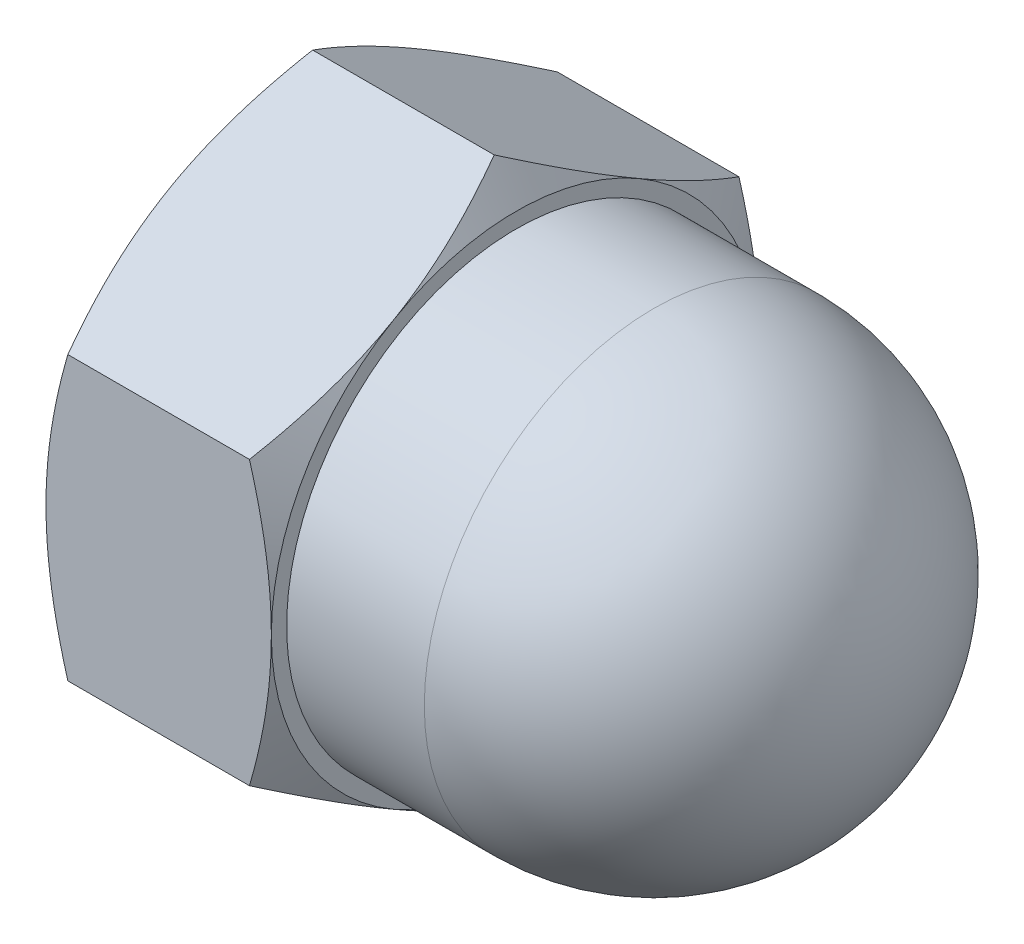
ISO-10303-21;
HEADER;
FILE_DESCRIPTION(('STEP AP214'),'2;1');
FILE_NAME('part.step','',(''),(''),'','','');
FILE_SCHEMA(('AUTOMOTIVE_DESIGN { 1 0 10303 214 1 1 1 1 }'));
ENDSEC;
DATA;
#1=APPLICATION_CONTEXT('core data for automotive mechanical design processes');
#2=APPLICATION_PROTOCOL_DEFINITION('international standard','automotive_design',2000,#1);
#3=PRODUCT_CONTEXT('',#1,'mechanical');
#4=PRODUCT('Part','Part','',(#3));
#5=PRODUCT_RELATED_PRODUCT_CATEGORY('part','',(#4));
#6=PRODUCT_DEFINITION_FORMATION('','',#4);
#7=PRODUCT_DEFINITION_CONTEXT('part definition',#1,'design');
#8=PRODUCT_DEFINITION('design','',#6,#7);
#9=PRODUCT_DEFINITION_SHAPE('','',#8);
#10=(LENGTH_UNIT() NAMED_UNIT(*) SI_UNIT(.MILLI.,.METRE.));
#11=(NAMED_UNIT(*) PLANE_ANGLE_UNIT() SI_UNIT($,.RADIAN.));
#12=(NAMED_UNIT(*) SI_UNIT($,.STERADIAN.) SOLID_ANGLE_UNIT());
#13=UNCERTAINTY_MEASURE_WITH_UNIT(LENGTH_MEASURE(1.E-05),#10,'distance_accuracy_value','');
#14=(GEOMETRIC_REPRESENTATION_CONTEXT(3) GLOBAL_UNCERTAINTY_ASSIGNED_CONTEXT((#13)) GLOBAL_UNIT_ASSIGNED_CONTEXT((#10,
#11,#12)) REPRESENTATION_CONTEXT('',''));
#15=CARTESIAN_POINT('',(0.,0.,0.));
#16=DIRECTION('',(0.,0.,1.));
#17=DIRECTION('',(1.,0.,0.));
#18=AXIS2_PLACEMENT_3D('',#15,#16,#17);
#19=CARTESIAN_POINT('',(6.25,0.,0.));
#20=DIRECTION('',(1.,0.,0.));
#21=DIRECTION('',(0.,1.,0.));
#22=AXIS2_PLACEMENT_3D('',#19,#20,#21);
#23=SPHERICAL_SURFACE('',#22,3.75);
#24=CARTESIAN_POINT('',(10.,0.,0.));
#25=VERTEX_POINT('',#24);
#26=VERTEX_LOOP('',#25);
#27=FACE_BOUND('',#26,.T.);
#28=CARTESIAN_POINT('',(6.25,0.,0.));
#29=DIRECTION('',(1.,0.,0.));
#30=DIRECTION('',(0.,0.,-1.));
#31=AXIS2_PLACEMENT_3D('',#28,#29,#30);
#32=CIRCLE('',#31,3.75);
#33=CARTESIAN_POINT('',(6.25,0.,-3.75));
#34=VERTEX_POINT('',#33);
#35=EDGE_CURVE('E306',#34,#34,#32,.F.);
#36=ORIENTED_EDGE('',*,*,#35,.F.);
#37=EDGE_LOOP('',(#36));
#38=FACE_BOUND('',#37,.T.);
#39=ADVANCED_FACE('F16',(#27,#38),#23,.T.);
#40=CARTESIAN_POINT('',(5.125,0.,0.));
#41=DIRECTION('',(1.,0.,0.));
#42=DIRECTION('',(0.,0.,-1.));
#43=AXIS2_PLACEMENT_3D('',#40,#41,#42);
#44=CYLINDRICAL_SURFACE('',#43,3.75);
#45=CARTESIAN_POINT('',(4.,0.,0.));
#46=DIRECTION('',(1.,0.,0.));
#47=DIRECTION('',(0.,0.,-1.));
#48=AXIS2_PLACEMENT_3D('',#45,#46,#47);
#49=CIRCLE('',#48,3.75);
#50=CARTESIAN_POINT('',(4.,0.,-3.75));
#51=VERTEX_POINT('',#50);
#52=EDGE_CURVE('E20',#51,#51,#49,.F.);
#53=ORIENTED_EDGE('',*,*,#52,.F.);
#54=EDGE_LOOP('',(#53));
#55=FACE_BOUND('',#54,.T.);
#56=ORIENTED_EDGE('',*,*,#35,.T.);
#57=EDGE_LOOP('',(#56));
#58=FACE_BOUND('',#57,.T.);
#59=ADVANCED_FACE('F317',(#55,#58),#44,.T.);
#60=CARTESIAN_POINT('',(4.,0.,0.));
#61=DIRECTION('',(1.,0.,0.));
#62=DIRECTION('',(0.,0.,-1.));
#63=AXIS2_PLACEMENT_3D('',#60,#61,#62);
#64=PLANE('',#63);
#65=ORIENTED_EDGE('',*,*,#52,.T.);
#66=EDGE_LOOP('',(#65));
#67=FACE_BOUND('',#66,.T.);
#68=CARTESIAN_POINT('',(4.00000000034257,0.,0.));
#69=DIRECTION('',(-1.,0.,0.));
#70=DIRECTION('',(0.,0.,1.));
#71=AXIS2_PLACEMENT_3D('',#68,#69,#70);
#72=CIRCLE('',#71,4.00000000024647);
#73=CARTESIAN_POINT('',(4.00000000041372,-3.46410161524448,-2.00000000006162));
#74=VERTEX_POINT('',#73);
#75=CARTESIAN_POINT('',(4.00000000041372,-3.46410161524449,2.00000000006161));
#76=VERTEX_POINT('',#75);
#77=EDGE_CURVE('E88',#74,#76,#72,.T.);
#78=ORIENTED_EDGE('',*,*,#77,.F.);
#79=CARTESIAN_POINT('',(4.00000000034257,0.,0.));
#80=DIRECTION('',(-1.,0.,0.));
#81=DIRECTION('',(0.,0.,1.));
#82=AXIS2_PLACEMENT_3D('',#79,#80,#81);
#83=CIRCLE('',#82,4.00000000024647);
#84=CARTESIAN_POINT('',(4.00000000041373,0.,-4.00000000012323));
#85=VERTEX_POINT('',#84);
#86=EDGE_CURVE('E281',#85,#74,#83,.T.);
#87=ORIENTED_EDGE('',*,*,#86,.F.);
#88=CARTESIAN_POINT('',(4.00000000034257,0.,0.));
#89=DIRECTION('',(-1.,0.,0.));
#90=DIRECTION('',(0.,0.,1.));
#91=AXIS2_PLACEMENT_3D('',#88,#89,#90);
#92=CIRCLE('',#91,4.00000000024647);
#93=CARTESIAN_POINT('',(4.00000000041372,3.46410161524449,-2.00000000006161));
#94=VERTEX_POINT('',#93);
#95=EDGE_CURVE('E284',#94,#85,#92,.T.);
#96=ORIENTED_EDGE('',*,*,#95,.F.);
#97=CARTESIAN_POINT('',(4.00000000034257,0.,0.));
#98=DIRECTION('',(-1.,0.,0.));
#99=DIRECTION('',(0.,0.,1.));
#100=AXIS2_PLACEMENT_3D('',#97,#98,#99);
#101=CIRCLE('',#100,4.00000000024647);
#102=CARTESIAN_POINT('',(4.00000000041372,3.46410161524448,2.00000000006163));
#103=VERTEX_POINT('',#102);
#104=EDGE_CURVE('E106',#103,#94,#101,.T.);
#105=ORIENTED_EDGE('',*,*,#104,.F.);
#106=CARTESIAN_POINT('',(4.00000000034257,0.,0.));
#107=DIRECTION('',(-1.,0.,0.));
#108=DIRECTION('',(0.,0.,1.));
#109=AXIS2_PLACEMENT_3D('',#106,#107,#108);
#110=CIRCLE('',#109,4.00000000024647);
#111=CARTESIAN_POINT('',(4.00000000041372,0.,4.00000000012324));
#112=VERTEX_POINT('',#111);
#113=EDGE_CURVE('E102',#112,#103,#110,.T.);
#114=ORIENTED_EDGE('',*,*,#113,.F.);
#115=CARTESIAN_POINT('',(4.00000000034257,0.,0.));
#116=DIRECTION('',(-1.,0.,0.));
#117=DIRECTION('',(0.,0.,1.));
#118=AXIS2_PLACEMENT_3D('',#115,#116,#117);
#119=CIRCLE('',#118,4.00000000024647);
#120=EDGE_CURVE('E94',#76,#112,#119,.T.);
#121=ORIENTED_EDGE('',*,*,#120,.F.);
#122=EDGE_LOOP('',(#78,#87,#96,#105,#114,#121));
#123=FACE_BOUND('',#122,.T.);
#124=ADVANCED_FACE('F104',(#67,#123),#64,.T.);
#125=CARTESIAN_POINT('',(3.6405908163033,0.,0.));
#126=DIRECTION('',(-1.,0.,0.));
#127=DIRECTION('',(0.,0.,1.));
#128=AXIS2_PLACEMENT_3D('',#125,#126,#127);
#129=CONICAL_SURFACE('',#128,4.62251496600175,1.0471975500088);
#130=CARTESIAN_POINT('',(4.0000000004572,-3.46410161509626,1.99999999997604));
#131=CARTESIAN_POINT('',(4.00001634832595,-3.41509105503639,2.08488878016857));
#132=CARTESIAN_POINT('',(3.99792016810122,-3.3660828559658,2.16977347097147));
#133=CARTESIAN_POINT('',(3.98962425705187,-3.26816268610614,2.33937618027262));
#134=CARTESIAN_POINT('',(3.98342533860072,-3.21925069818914,2.4240942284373));
#135=CARTESIAN_POINT('',(3.96708627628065,-3.12183888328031,2.59281644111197));
#136=CARTESIAN_POINT('',(3.95696597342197,-3.07333821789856,2.67682205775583));
#137=CARTESIAN_POINT('',(3.93300183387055,-2.97656796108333,2.84443305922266));
#138=CARTESIAN_POINT('',(3.91915789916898,-2.92829837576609,2.92803843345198));
#139=CARTESIAN_POINT('',(3.87246832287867,-2.78403632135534,3.17790764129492));
#140=CARTESIAN_POINT('',(3.83444223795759,-2.68846293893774,3.34344559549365));
#141=CARTESIAN_POINT('',(3.74674436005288,-2.49813806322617,3.67309795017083));
#142=CARTESIAN_POINT('',(3.69701440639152,-2.40339320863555,3.83720085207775));
#143=CARTESIAN_POINT('',(3.64273440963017,-2.3094010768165,3.99999999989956));
#144=B_SPLINE_CURVE_WITH_KNOTS('',3,(#130,#131,#132,#133,#134,#135,#136,#137,#138,#139,#140,
#141,#142,#143),.UNSPECIFIED.,.F.,.F.,(4,2,2,2,2,2,4),(0.,0.294033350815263,0.588008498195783,
0.880515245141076,1.17302969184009,1.7572919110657,2.34452123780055),.UNSPECIFIED.);
#145=CARTESIAN_POINT('',(3.64273440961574,-2.3094010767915,3.99999999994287));
#146=VERTEX_POINT('',#145);
#147=EDGE_CURVE('E99',#76,#146,#144,.T.);
#148=ORIENTED_EDGE('',*,*,#147,.F.);
#149=ORIENTED_EDGE('',*,*,#120,.T.);
#150=CARTESIAN_POINT('',(3.64273440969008,-2.30940107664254,4.00000000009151));
#151=CARTESIAN_POINT('',(3.69701440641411,-2.1214168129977,4.00000000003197));
#152=CARTESIAN_POINT('',(3.74674436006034,-1.93192710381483,4.00000000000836));
#153=CARTESIAN_POINT('',(3.83444223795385,-1.55127735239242,3.99999999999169));
#154=CARTESIAN_POINT('',(3.87246832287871,-1.36013058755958,3.99999999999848));
#155=CARTESIAN_POINT('',(3.91915789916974,-1.07160647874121,4.00000000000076));
#156=CARTESIAN_POINT('',(3.93300183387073,-0.975067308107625,4.00000000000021));
#157=CARTESIAN_POINT('',(3.95696597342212,-0.781526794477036,3.9999999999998));
#158=CARTESIAN_POINT('',(3.96708627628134,-0.684525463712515,3.99999999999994));
#159=CARTESIAN_POINT('',(3.98342533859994,-0.489701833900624,4.00000000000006));
#160=CARTESIAN_POINT('',(3.98962425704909,-0.391877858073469,4.00000000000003));
#161=CARTESIAN_POINT('',(3.99792016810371,-0.196037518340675,3.99999999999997));
#162=CARTESIAN_POINT('',(4.00001634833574,-0.098021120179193,3.99999999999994));
#163=CARTESIAN_POINT('',(4.00000000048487,-7.99137315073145E-12,4.));
#164=B_SPLINE_CURVE_WITH_KNOTS('',3,(#150,#151,#152,#153,#154,#155,#156,#157,#158,#159,#160,
#161,#162,#163),.UNSPECIFIED.,.F.,.F.,(4,2,2,2,2,2,4),(0.,0.587229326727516,1.17149154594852,
1.46400599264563,1.75651273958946,2.05048788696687,2.34452123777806),.UNSPECIFIED.);
#165=EDGE_CURVE('E98',#146,#112,#164,.T.);
#166=ORIENTED_EDGE('',*,*,#165,.F.);
#167=EDGE_LOOP('',(#148,#149,#166));
#168=FACE_BOUND('',#167,.T.);
#169=ADVANCED_FACE('F96',(#168),#129,.T.);
#170=CARTESIAN_POINT('',(3.6405908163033,0.,0.));
#171=DIRECTION('',(-1.,0.,0.));
#172=DIRECTION('',(0.,0.,1.));
#173=AXIS2_PLACEMENT_3D('',#170,#171,#172);
#174=CONICAL_SURFACE('',#173,4.62251496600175,1.0471975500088);
#175=ORIENTED_EDGE('',*,*,#113,.T.);
#176=CARTESIAN_POINT('',(3.64273440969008,2.30940107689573,3.99999999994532));
#177=CARTESIAN_POINT('',(3.69701440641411,2.40339320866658,3.83720085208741));
#178=CARTESIAN_POINT('',(3.74674436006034,2.49813806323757,3.67309795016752));
#179=CARTESIAN_POINT('',(3.83444223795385,2.68846293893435,3.34344559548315));
#180=CARTESIAN_POINT('',(3.87246832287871,2.78403632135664,3.17790764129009));
#181=CARTESIAN_POINT('',(3.91915789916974,2.92829837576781,2.92803843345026));
#182=CARTESIAN_POINT('',(3.93300183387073,2.97656796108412,2.84443305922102));
#183=CARTESIAN_POINT('',(3.95696597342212,3.07333821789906,2.67682205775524));
#184=CARTESIAN_POINT('',(3.96708627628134,3.12183888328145,2.59281644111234));
#185=CARTESIAN_POINT('',(3.98342533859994,3.21925069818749,2.4240942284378));
#186=CARTESIAN_POINT('',(3.98962425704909,3.26816268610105,2.33937618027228));
#187=CARTESIAN_POINT('',(3.99792016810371,3.36608285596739,2.16977347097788));
#188=CARTESIAN_POINT('',(4.00001634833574,3.41509105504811,2.08488878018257));
#189=CARTESIAN_POINT('',(4.00000000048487,3.46410161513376,2.00000000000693));
#190=B_SPLINE_CURVE_WITH_KNOTS('',3,(#176,#177,#178,#179,#180,#181,#182,#183,#184,#185,#186,
#187,#188,#189),.UNSPECIFIED.,.F.,.F.,(4,2,2,2,2,2,4),(0.,0.587229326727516,1.17149154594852,
1.46400599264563,1.75651273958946,2.05048788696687,2.34452123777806),.UNSPECIFIED.);
#191=CARTESIAN_POINT('',(3.64273440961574,2.30940107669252,4.00000000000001));
#192=VERTEX_POINT('',#191);
#193=EDGE_CURVE('E122',#192,#103,#190,.T.);
#194=ORIENTED_EDGE('',*,*,#193,.F.);
#195=CARTESIAN_POINT('',(4.0000000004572,0.,3.99999999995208));
#196=CARTESIAN_POINT('',(4.00001634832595,0.09802112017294,3.9999999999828));
#197=CARTESIAN_POINT('',(3.99792016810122,0.196037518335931,3.99999999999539));
#198=CARTESIAN_POINT('',(3.98962425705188,0.391877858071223,4.00000000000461));
#199=CARTESIAN_POINT('',(3.98342533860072,0.489701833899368,4.00000000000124));
#200=CARTESIAN_POINT('',(3.96708627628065,0.684525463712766,3.99999999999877));
#201=CARTESIAN_POINT('',(3.95696597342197,0.781526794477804,3.99999999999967));
#202=CARTESIAN_POINT('',(3.93300183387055,0.975067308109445,4.00000000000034));
#203=CARTESIAN_POINT('',(3.91915789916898,1.07160647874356,4.00000000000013));
#204=CARTESIAN_POINT('',(3.87246832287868,1.36013058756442,3.99999999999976));
#205=CARTESIAN_POINT('',(3.8344422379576,1.55127735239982,3.99999999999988));
#206=CARTESIAN_POINT('',(3.74674436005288,1.9319271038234,4.00000000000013));
#207=CARTESIAN_POINT('',(3.69701440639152,2.12141681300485,4.00000000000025));
#208=CARTESIAN_POINT('',(3.64273440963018,2.30940107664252,4.));
#209=B_SPLINE_CURVE_WITH_KNOTS('',3,(#195,#196,#197,#198,#199,#200,#201,#202,#203,#204,#205,
#206,#207,#208),.UNSPECIFIED.,.F.,.F.,(4,2,2,2,2,2,4),(0.,0.294033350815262,0.588008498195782,
0.880515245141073,1.17302969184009,1.7572919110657,2.34452123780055),.UNSPECIFIED.);
#210=EDGE_CURVE('E117',#112,#192,#209,.T.);
#211=ORIENTED_EDGE('',*,*,#210,.F.);
#212=EDGE_LOOP('',(#175,#194,#211));
#213=FACE_BOUND('',#212,.T.);
#214=ADVANCED_FACE('F124',(#213),#174,.T.);
#215=CARTESIAN_POINT('',(3.6405908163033,0.,0.));
#216=DIRECTION('',(-1.,0.,0.));
#217=DIRECTION('',(0.,0.,1.));
#218=AXIS2_PLACEMENT_3D('',#215,#216,#217);
#219=CONICAL_SURFACE('',#218,4.62251496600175,1.0471975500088);
#220=ORIENTED_EDGE('',*,*,#104,.T.);
#221=CARTESIAN_POINT('',(3.64273440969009,4.61880215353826,-1.46183903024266E-10));
#222=CARTESIAN_POINT('',(3.69701440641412,4.52481002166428,-0.162799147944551));
#223=CARTESIAN_POINT('',(3.74674436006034,4.43006516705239,-0.32690204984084));
#224=CARTESIAN_POINT('',(3.83444223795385,4.23974029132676,-0.656554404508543));
#225=CARTESIAN_POINT('',(3.87246832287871,4.14416690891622,-0.822092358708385));
#226=CARTESIAN_POINT('',(3.91915789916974,3.99990485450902,-1.0719615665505));
#227=CARTESIAN_POINT('',(3.93300183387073,3.95163526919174,-1.15556694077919));
#228=CARTESIAN_POINT('',(3.95696597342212,3.85486501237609,-1.32317794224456));
#229=CARTESIAN_POINT('',(3.96708627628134,3.80636434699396,-1.4071835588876));
#230=CARTESIAN_POINT('',(3.98342533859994,3.70895253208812,-1.57590577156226));
#231=CARTESIAN_POINT('',(3.98962425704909,3.66004054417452,-1.66062381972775));
#232=CARTESIAN_POINT('',(3.99792016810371,3.56212037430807,-1.8302265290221));
#233=CARTESIAN_POINT('',(4.00001634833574,3.5131121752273,-1.91511121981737));
#234=CARTESIAN_POINT('',(4.00000000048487,3.46410161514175,-1.99999999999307));
#235=B_SPLINE_CURVE_WITH_KNOTS('',3,(#221,#222,#223,#224,#225,#226,#227,#228,#229,#230,#231,
#232,#233,#234),.UNSPECIFIED.,.F.,.F.,(4,2,2,2,2,2,4),(0.,0.587229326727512,1.17149154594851,
1.46400599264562,1.75651273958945,2.05048788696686,2.34452123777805),.UNSPECIFIED.);
#236=CARTESIAN_POINT('',(3.64273440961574,4.61880215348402,5.71387160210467E-11));
#237=VERTEX_POINT('',#236);
#238=EDGE_CURVE('E289',#237,#94,#235,.T.);
#239=ORIENTED_EDGE('',*,*,#238,.F.);
#240=CARTESIAN_POINT('',(4.0000000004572,3.46410161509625,1.99999999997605));
#241=CARTESIAN_POINT('',(4.00001634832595,3.51311217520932,1.91511121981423));
#242=CARTESIAN_POINT('',(3.99792016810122,3.56212037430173,1.83022652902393));
#243=CARTESIAN_POINT('',(3.98962425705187,3.66004054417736,1.660623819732));
#244=CARTESIAN_POINT('',(3.98342533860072,3.70895253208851,1.57590577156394));
#245=CARTESIAN_POINT('',(3.96708627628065,3.80636434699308,1.40718355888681));
#246=CARTESIAN_POINT('',(3.95696597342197,3.85486501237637,1.32317794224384));
#247=CARTESIAN_POINT('',(3.93300183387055,3.95163526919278,1.15556694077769));
#248=CARTESIAN_POINT('',(3.91915789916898,3.99990485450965,1.07196156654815));
#249=CARTESIAN_POINT('',(3.87246832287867,4.14416690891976,0.822092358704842));
#250=CARTESIAN_POINT('',(3.83444223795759,4.23974029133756,0.656554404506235));
#251=CARTESIAN_POINT('',(3.74674436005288,4.43006516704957,0.326902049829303));
#252=CARTESIAN_POINT('',(3.69701440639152,4.5248100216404,0.162799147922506));
#253=CARTESIAN_POINT('',(3.64273440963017,4.61880215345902,1.00448255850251E-10));
#254=B_SPLINE_CURVE_WITH_KNOTS('',3,(#240,#241,#242,#243,#244,#245,#246,#247,#248,#249,#250,
#251,#252,#253),.UNSPECIFIED.,.F.,.F.,(4,2,2,2,2,2,4),(0.,0.294033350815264,0.588008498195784,
0.880515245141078,1.17302969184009,1.75729191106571,2.34452123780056),.UNSPECIFIED.);
#255=EDGE_CURVE('E160',#103,#237,#254,.T.);
#256=ORIENTED_EDGE('',*,*,#255,.F.);
#257=EDGE_LOOP('',(#220,#239,#256));
#258=FACE_BOUND('',#257,.T.);
#259=ADVANCED_FACE('F150',(#258),#219,.T.);
#260=CARTESIAN_POINT('',(3.6405908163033,0.,0.));
#261=DIRECTION('',(-1.,0.,0.));
#262=DIRECTION('',(0.,0.,1.));
#263=AXIS2_PLACEMENT_3D('',#260,#261,#262);
#264=CONICAL_SURFACE('',#263,4.62251496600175,1.0471975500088);
#265=ORIENTED_EDGE('',*,*,#95,.T.);
#266=CARTESIAN_POINT('',(3.64273440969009,2.30940107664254,-4.00000000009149));
#267=CARTESIAN_POINT('',(3.69701440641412,2.1214168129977,-4.00000000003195));
#268=CARTESIAN_POINT('',(3.74674436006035,1.93192710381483,-4.00000000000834));
#269=CARTESIAN_POINT('',(3.83444223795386,1.55127735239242,-3.99999999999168));
#270=CARTESIAN_POINT('',(3.87246832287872,1.36013058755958,-3.99999999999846));
#271=CARTESIAN_POINT('',(3.91915789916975,1.07160647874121,-4.00000000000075));
#272=CARTESIAN_POINT('',(3.93300183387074,0.97506730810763,-4.00000000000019));
#273=CARTESIAN_POINT('',(3.95696597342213,0.78152679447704,-3.99999999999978));
#274=CARTESIAN_POINT('',(3.96708627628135,0.68452546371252,-3.99999999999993));
#275=CARTESIAN_POINT('',(3.98342533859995,0.489701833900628,-4.00000000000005));
#276=CARTESIAN_POINT('',(3.9896242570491,0.391877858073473,-4.00000000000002));
#277=CARTESIAN_POINT('',(3.99792016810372,0.19603751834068,-3.99999999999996));
#278=CARTESIAN_POINT('',(4.00001634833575,0.0980211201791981,-3.99999999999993));
#279=CARTESIAN_POINT('',(4.00000000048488,7.99652713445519E-12,-3.99999999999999));
#280=B_SPLINE_CURVE_WITH_KNOTS('',3,(#266,#267,#268,#269,#270,#271,#272,#273,#274,#275,#276,
#277,#278,#279),.UNSPECIFIED.,.F.,.F.,(4,2,2,2,2,2,4),(0.,0.587229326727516,1.17149154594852,
1.46400599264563,1.75651273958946,2.05048788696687,2.34452123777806),.UNSPECIFIED.);
#281=CARTESIAN_POINT('',(3.64273440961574,2.3094010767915,-3.99999999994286));
#282=VERTEX_POINT('',#281);
#283=EDGE_CURVE('E232',#282,#85,#280,.T.);
#284=ORIENTED_EDGE('',*,*,#283,.F.);
#285=CARTESIAN_POINT('',(4.00000000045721,3.46410161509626,-1.99999999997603));
#286=CARTESIAN_POINT('',(4.00001634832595,3.41509105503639,-2.08488878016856));
#287=CARTESIAN_POINT('',(3.99792016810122,3.3660828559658,-2.16977347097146));
#288=CARTESIAN_POINT('',(3.98962425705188,3.26816268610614,-2.33937618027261));
#289=CARTESIAN_POINT('',(3.98342533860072,3.21925069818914,-2.42409422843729));
#290=CARTESIAN_POINT('',(3.96708627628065,3.12183888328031,-2.59281644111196));
#291=CARTESIAN_POINT('',(3.95696597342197,3.07333821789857,-2.67682205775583));
#292=CARTESIAN_POINT('',(3.93300183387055,2.97656796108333,-2.84443305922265));
#293=CARTESIAN_POINT('',(3.91915789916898,2.92829837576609,-2.92803843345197));
#294=CARTESIAN_POINT('',(3.87246832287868,2.78403632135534,-3.17790764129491));
#295=CARTESIAN_POINT('',(3.8344422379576,2.68846293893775,-3.34344559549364));
#296=CARTESIAN_POINT('',(3.74674436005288,2.49813806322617,-3.67309795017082));
#297=CARTESIAN_POINT('',(3.69701440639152,2.40339320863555,-3.83720085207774));
#298=CARTESIAN_POINT('',(3.64273440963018,2.3094010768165,-3.99999999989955));
#299=B_SPLINE_CURVE_WITH_KNOTS('',3,(#285,#286,#287,#288,#289,#290,#291,#292,#293,#294,#295,
#296,#297,#298),.UNSPECIFIED.,.F.,.F.,(4,2,2,2,2,2,4),(0.,0.294033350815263,0.588008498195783,
0.880515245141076,1.17302969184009,1.7572919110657,2.34452123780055),.UNSPECIFIED.);
#300=EDGE_CURVE('E239',#94,#282,#299,.T.);
#301=ORIENTED_EDGE('',*,*,#300,.F.);
#302=EDGE_LOOP('',(#265,#284,#301));
#303=FACE_BOUND('',#302,.T.);
#304=ADVANCED_FACE('F243',(#303),#264,.T.);
#305=CARTESIAN_POINT('',(3.6405908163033,0.,0.));
#306=DIRECTION('',(-1.,0.,0.));
#307=DIRECTION('',(0.,0.,1.));
#308=AXIS2_PLACEMENT_3D('',#305,#306,#307);
#309=CONICAL_SURFACE('',#308,4.62251496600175,1.0471975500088);
#310=CARTESIAN_POINT('',(4.00000000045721,-3.46410161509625,-1.99999999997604));
#311=CARTESIAN_POINT('',(4.00001634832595,-3.51311217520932,-1.91511121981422));
#312=CARTESIAN_POINT('',(3.99792016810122,-3.56212037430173,-1.83022652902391));
#313=CARTESIAN_POINT('',(3.98962425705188,-3.66004054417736,-1.66062381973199));
#314=CARTESIAN_POINT('',(3.98342533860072,-3.70895253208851,-1.57590577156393));
#315=CARTESIAN_POINT('',(3.96708627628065,-3.80636434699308,-1.4071835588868));
#316=CARTESIAN_POINT('',(3.95696597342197,-3.85486501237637,-1.32317794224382));
#317=CARTESIAN_POINT('',(3.93300183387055,-3.95163526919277,-1.15556694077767));
#318=CARTESIAN_POINT('',(3.91915789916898,-3.99990485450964,-1.07196156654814));
#319=CARTESIAN_POINT('',(3.87246832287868,-4.14416690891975,-0.822092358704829));
#320=CARTESIAN_POINT('',(3.8344422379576,-4.23974029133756,-0.656554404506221));
#321=CARTESIAN_POINT('',(3.74674436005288,-4.43006516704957,-0.326902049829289));
#322=CARTESIAN_POINT('',(3.69701440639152,-4.5248100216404,-0.162799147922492));
#323=CARTESIAN_POINT('',(3.64273440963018,-4.61880215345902,-1.00433993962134E-10));
#324=B_SPLINE_CURVE_WITH_KNOTS('',3,(#310,#311,#312,#313,#314,#315,#316,#317,#318,#319,#320,
#321,#322,#323),.UNSPECIFIED.,.F.,.F.,(4,2,2,2,2,2,4),(0.,0.294033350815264,0.588008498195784,
0.880515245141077,1.17302969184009,1.75729191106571,2.34452123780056),.UNSPECIFIED.);
#325=CARTESIAN_POINT('',(3.64273440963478,-4.61880215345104,0.));
#326=VERTEX_POINT('',#325);
#327=EDGE_CURVE('E254',#74,#326,#324,.T.);
#328=ORIENTED_EDGE('',*,*,#327,.F.);
#329=ORIENTED_EDGE('',*,*,#77,.T.);
#330=CARTESIAN_POINT('',(3.64273440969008,-4.61880215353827,1.46195232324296E-10));
#331=CARTESIAN_POINT('',(3.69701440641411,-4.52481002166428,0.162799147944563));
#332=CARTESIAN_POINT('',(3.74674436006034,-4.4300651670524,0.326902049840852));
#333=CARTESIAN_POINT('',(3.83444223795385,-4.23974029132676,0.656554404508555));
#334=CARTESIAN_POINT('',(3.87246832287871,-4.14416690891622,0.822092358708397));
#335=CARTESIAN_POINT('',(3.91915789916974,-3.99990485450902,1.07196156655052));
#336=CARTESIAN_POINT('',(3.93300183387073,-3.95163526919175,1.1555669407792));
#337=CARTESIAN_POINT('',(3.95696597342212,-3.8548650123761,1.32317794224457));
#338=CARTESIAN_POINT('',(3.96708627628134,-3.80636434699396,1.40718355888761));
#339=CARTESIAN_POINT('',(3.98342533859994,-3.70895253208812,1.57590577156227));
#340=CARTESIAN_POINT('',(3.98962425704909,-3.66004054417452,1.66062381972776));
#341=CARTESIAN_POINT('',(3.99792016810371,-3.56212037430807,1.83022652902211));
#342=CARTESIAN_POINT('',(4.00001634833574,-3.5131121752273,1.91511121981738));
#343=CARTESIAN_POINT('',(4.00000000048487,-3.46410161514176,1.99999999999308));
#344=B_SPLINE_CURVE_WITH_KNOTS('',3,(#330,#331,#332,#333,#334,#335,#336,#337,#338,#339,#340,
#341,#342,#343),.UNSPECIFIED.,.F.,.F.,(4,2,2,2,2,2,4),(0.,0.587229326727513,1.17149154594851,
1.46400599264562,1.75651273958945,2.05048788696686,2.34452123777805),.UNSPECIFIED.);
#345=EDGE_CURVE('E125',#326,#76,#344,.T.);
#346=ORIENTED_EDGE('',*,*,#345,.F.);
#347=EDGE_LOOP('',(#328,#329,#346));
#348=FACE_BOUND('',#347,.T.);
#349=ADVANCED_FACE('F246',(#348),#309,.T.);
#350=CARTESIAN_POINT('',(3.6405908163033,0.,0.));
#351=DIRECTION('',(-1.,0.,0.));
#352=DIRECTION('',(0.,0.,1.));
#353=AXIS2_PLACEMENT_3D('',#350,#351,#352);
#354=CONICAL_SURFACE('',#353,4.62251496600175,1.0471975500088);
#355=CARTESIAN_POINT('',(4.00000000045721,0.,-3.99999999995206));
#356=CARTESIAN_POINT('',(4.00001634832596,-0.0980211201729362,-3.99999999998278));
#357=CARTESIAN_POINT('',(3.99792016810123,-0.196037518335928,-3.99999999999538));
#358=CARTESIAN_POINT('',(3.98962425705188,-0.391877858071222,-4.0000000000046));
#359=CARTESIAN_POINT('',(3.98342533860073,-0.489701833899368,-4.00000000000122));
#360=CARTESIAN_POINT('',(3.96708627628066,-0.684525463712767,-3.99999999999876));
#361=CARTESIAN_POINT('',(3.95696597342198,-0.781526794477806,-3.99999999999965));
#362=CARTESIAN_POINT('',(3.93300183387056,-0.975067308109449,-4.00000000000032));
#363=CARTESIAN_POINT('',(3.91915789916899,-1.07160647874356,-4.00000000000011));
#364=CARTESIAN_POINT('',(3.87246832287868,-1.36013058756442,-3.99999999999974));
#365=CARTESIAN_POINT('',(3.8344422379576,-1.55127735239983,-3.99999999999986));
#366=CARTESIAN_POINT('',(3.74674436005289,-1.93192710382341,-4.00000000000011));
#367=CARTESIAN_POINT('',(3.69701440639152,-2.12141681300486,-4.00000000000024));
#368=CARTESIAN_POINT('',(3.64273440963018,-2.30940107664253,-3.99999999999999));
#369=B_SPLINE_CURVE_WITH_KNOTS('',3,(#355,#356,#357,#358,#359,#360,#361,#362,#363,#364,#365,
#366,#367,#368),.UNSPECIFIED.,.F.,.F.,(4,2,2,2,2,2,4),(0.,0.294033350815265,0.588008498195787,
0.880515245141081,1.1730296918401,1.75729191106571,2.34452123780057),.UNSPECIFIED.);
#370=CARTESIAN_POINT('',(3.64273440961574,-2.30940107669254,-3.99999999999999));
#371=VERTEX_POINT('',#370);
#372=EDGE_CURVE('E225',#85,#371,#369,.T.);
#373=ORIENTED_EDGE('',*,*,#372,.F.);
#374=ORIENTED_EDGE('',*,*,#86,.T.);
#375=CARTESIAN_POINT('',(3.64273440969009,-2.30940107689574,-3.99999999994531));
#376=CARTESIAN_POINT('',(3.69701440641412,-2.40339320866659,-3.8372008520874));
#377=CARTESIAN_POINT('',(3.74674436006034,-2.49813806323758,-3.6730979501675));
#378=CARTESIAN_POINT('',(3.83444223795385,-2.68846293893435,-3.34344559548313));
#379=CARTESIAN_POINT('',(3.87246832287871,-2.78403632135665,-3.17790764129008));
#380=CARTESIAN_POINT('',(3.91915789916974,-2.92829837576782,-2.92803843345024));
#381=CARTESIAN_POINT('',(3.93300183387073,-2.97656796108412,-2.84443305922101));
#382=CARTESIAN_POINT('',(3.95696597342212,-3.07333821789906,-2.67682205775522));
#383=CARTESIAN_POINT('',(3.96708627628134,-3.12183888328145,-2.59281644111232));
#384=CARTESIAN_POINT('',(3.98342533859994,-3.2192506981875,-2.42409422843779));
#385=CARTESIAN_POINT('',(3.98962425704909,-3.26816268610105,-2.33937618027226));
#386=CARTESIAN_POINT('',(3.99792016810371,-3.36608285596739,-2.16977347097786));
#387=CARTESIAN_POINT('',(4.00001634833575,-3.41509105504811,-2.08488878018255));
#388=CARTESIAN_POINT('',(4.00000000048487,-3.46410161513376,-2.00000000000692));
#389=B_SPLINE_CURVE_WITH_KNOTS('',3,(#375,#376,#377,#378,#379,#380,#381,#382,#383,#384,#385,
#386,#387,#388),.UNSPECIFIED.,.F.,.F.,(4,2,2,2,2,2,4),(0.,0.587229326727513,1.17149154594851,
1.46400599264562,1.75651273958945,2.05048788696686,2.34452123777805),.UNSPECIFIED.);
#390=EDGE_CURVE('E261',#371,#74,#389,.T.);
#391=ORIENTED_EDGE('',*,*,#390,.F.);
#392=EDGE_LOOP('',(#373,#374,#391));
#393=FACE_BOUND('',#392,.T.);
#394=ADVANCED_FACE('F251',(#393),#354,.T.);
#395=CARTESIAN_POINT('',(0.,-4.61880215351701,0.));
#396=DIRECTION('',(0.,-0.866025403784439,0.499999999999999));
#397=DIRECTION('',(0.,-0.499999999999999,-0.866025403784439));
#398=AXIS2_PLACEMENT_3D('',#395,#396,#397);
#399=PLANE('',#398);
#400=DIRECTION('',(1.,0.,0.));
#401=VECTOR('',#400,1.);
#402=CARTESIAN_POINT('',(0.,-4.61880215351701,0.));
#403=LINE('',#402,#401);
#404=CARTESIAN_POINT('',(0.674808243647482,-4.61880216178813,1.43260083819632E-08));
#405=VERTEX_POINT('',#404);
#406=EDGE_CURVE('E259',#326,#405,#403,.F.);
#407=ORIENTED_EDGE('',*,*,#406,.F.);
#408=ORIENTED_EDGE('',*,*,#345,.T.);
#409=ORIENTED_EDGE('',*,*,#147,.T.);
#410=DIRECTION('',(1.,0.,0.));
#411=VECTOR('',#410,1.);
#412=CARTESIAN_POINT('',(0.,-2.30940107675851,4.));
#413=LINE('',#412,#411);
#414=CARTESIAN_POINT('',(0.674808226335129,-2.30940109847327,3.99999996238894));
#415=VERTEX_POINT('',#414);
#416=EDGE_CURVE('E121',#415,#146,#413,.T.);
#417=ORIENTED_EDGE('',*,*,#416,.F.);
#418=CARTESIAN_POINT('',(0.674808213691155,-4.61880211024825,7.528969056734E-08));
#419=CARTESIAN_POINT('',(0.616199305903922,-4.51731791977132,0.175775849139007));
#420=CARTESIAN_POINT('',(0.562897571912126,-4.41495771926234,0.353068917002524));
#421=CARTESIAN_POINT('',(0.469860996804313,-4.20846501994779,0.710724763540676));
#422=CARTESIAN_POINT('',(0.430159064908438,-4.10432885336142,0.891093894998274));
#423=CARTESIAN_POINT('',(0.368360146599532,-3.89734702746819,1.24959693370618));
#424=CARTESIAN_POINT('',(0.345851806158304,-3.79453320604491,1.42767569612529));
#425=CARTESIAN_POINT('',(0.318986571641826,-3.58842204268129,1.78467070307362));
#426=CARTESIAN_POINT('',(0.31460742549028,-3.48512544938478,1.96358565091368));
#427=CARTESIAN_POINT('',(0.32374082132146,-3.29212685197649,2.29786902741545));
#428=CARTESIAN_POINT('',(0.335010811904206,-3.20239588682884,2.453287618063));
#429=CARTESIAN_POINT('',(0.370722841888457,-3.02351852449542,2.76311229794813));
#430=CARTESIAN_POINT('',(0.395177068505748,-2.93437274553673,2.91751731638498));
#431=CARTESIAN_POINT('',(0.456307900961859,-2.75512687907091,3.22798026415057));
#432=CARTESIAN_POINT('',(0.493243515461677,-2.66504946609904,3.38399892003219));
#433=CARTESIAN_POINT('',(0.57707174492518,-2.48623775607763,3.69370988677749));
#434=CARTESIAN_POINT('',(0.623944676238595,-2.39750117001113,3.84740616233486));
#435=CARTESIAN_POINT('',(0.674808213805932,-2.30940112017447,3.99999992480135));
#436=B_SPLINE_CURVE_WITH_KNOTS('',3,(#418,#419,#420,#421,#422,#423,#424,#425,#426,#427,#428,
#429,#430,#431,#432,#433,#434,#435),.UNSPECIFIED.,.F.,.F.,(4,2,2,2,2,2,2,2,4),(0.,
0.6340320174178,1.26958762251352,1.88941519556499,2.50848175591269,3.04741550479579,
3.58684828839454,4.13824310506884,4.68855576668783),.UNSPECIFIED.);
#437=EDGE_CURVE('E266',#405,#415,#436,.T.);
#438=ORIENTED_EDGE('',*,*,#437,.F.);
#439=EDGE_LOOP('',(#407,#408,#409,#417,#438));
#440=FACE_BOUND('',#439,.T.);
#441=ADVANCED_FACE('F271',(#440),#399,.T.);
#442=CARTESIAN_POINT('',(0.,-2.30940107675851,4.));
#443=DIRECTION('',(0.,0.,1.));
#444=DIRECTION('',(1.,0.,0.));
#445=AXIS2_PLACEMENT_3D('',#442,#443,#444);
#446=PLANE('',#445);
#447=ORIENTED_EDGE('',*,*,#416,.T.);
#448=ORIENTED_EDGE('',*,*,#165,.T.);
#449=ORIENTED_EDGE('',*,*,#210,.T.);
#450=DIRECTION('',(1.,0.,0.));
#451=VECTOR('',#450,1.);
#452=CARTESIAN_POINT('',(0.,2.30940107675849,4.00000000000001));
#453=LINE('',#452,#451);
#454=CARTESIAN_POINT('',(0.674808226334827,2.30940103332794,4.00000000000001));
#455=VERTEX_POINT('',#454);
#456=EDGE_CURVE('E297',#455,#192,#453,.T.);
#457=ORIENTED_EDGE('',*,*,#456,.F.);
#458=CARTESIAN_POINT('',(0.674808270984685,-2.30940110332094,3.9999999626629));
#459=CARTESIAN_POINT('',(0.616199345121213,-2.1064327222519,3.99999998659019));
#460=CARTESIAN_POINT('',(0.562897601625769,-1.90171231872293,3.99999999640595));
#461=CARTESIAN_POINT('',(0.469861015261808,-1.48872691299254,4.0000000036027));
#462=CARTESIAN_POINT('',(0.430159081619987,-1.28045457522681,4.00000000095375));
#463=CARTESIAN_POINT('',(0.368360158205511,-0.8664909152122,3.99999999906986));
#464=CARTESIAN_POINT('',(0.345851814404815,-0.660863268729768,3.99999999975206));
#465=CARTESIAN_POINT('',(0.3189865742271,-0.248640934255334,4.00000000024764));
#466=CARTESIAN_POINT('',(0.314607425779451,-0.0420477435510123,4.0000000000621));
#467=CARTESIAN_POINT('',(0.323740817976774,0.343949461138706,3.99999999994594));
#468=CARTESIAN_POINT('',(0.335010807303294,0.523411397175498,3.99999999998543));
#469=CARTESIAN_POINT('',(0.370722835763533,0.881166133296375,4.00000000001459));
#470=CARTESIAN_POINT('',(0.395177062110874,1.05945769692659,4.00000000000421));
#471=CARTESIAN_POINT('',(0.456307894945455,1.41794944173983,3.9999999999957));
#472=CARTESIAN_POINT('',(0.493243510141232,1.59810427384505,3.99999999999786));
#473=CARTESIAN_POINT('',(0.577071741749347,1.95572770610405,4.00000000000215));
#474=CARTESIAN_POINT('',(0.623944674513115,2.13320088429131,4.00000000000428));
#475=CARTESIAN_POINT('',(0.674808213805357,2.30940098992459,4.));
#476=B_SPLINE_CURVE_WITH_KNOTS('',3,(#458,#459,#460,#461,#462,#463,#464,#465,#466,#467,#468,
#469,#470,#471,#472,#473,#474,#475),.UNSPECIFIED.,.F.,.F.,(4,2,2,2,2,2,2,2,4),(0.,
0.634032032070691,1.26958765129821,1.88941523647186,2.50848180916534,3.04741557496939,
3.58684837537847,4.13824321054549,4.68855589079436),.UNSPECIFIED.);
#477=EDGE_CURVE('E184',#415,#455,#476,.T.);
#478=ORIENTED_EDGE('',*,*,#477,.F.);
#479=EDGE_LOOP('',(#447,#448,#449,#457,#478));
#480=FACE_BOUND('',#479,.T.);
#481=ADVANCED_FACE('F115',(#480),#446,.T.);
#482=CARTESIAN_POINT('',(0.,2.30940107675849,4.00000000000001));
#483=DIRECTION('',(0.,0.866025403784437,0.500000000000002));
#484=DIRECTION('',(0.,-0.500000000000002,0.866025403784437));
#485=AXIS2_PLACEMENT_3D('',#482,#483,#484);
#486=PLANE('',#485);
#487=CARTESIAN_POINT('',(0.67480827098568,2.30940103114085,4.00000000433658));
#488=CARTESIAN_POINT('',(0.616199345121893,2.41088524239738,3.82422424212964));
#489=CARTESIAN_POINT('',(0.562897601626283,2.51324545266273,3.64693117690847));
#490=CARTESIAN_POINT('',(0.469861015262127,2.71973816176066,3.28927532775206));
#491=CARTESIAN_POINT('',(0.430159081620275,2.82387432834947,3.1089061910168));
#492=CARTESIAN_POINT('',(0.368360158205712,3.03085615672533,2.75040314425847));
#493=CARTESIAN_POINT('',(0.345851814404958,3.13366998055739,2.57232437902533));
#494=CARTESIAN_POINT('',(0.318986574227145,3.33978114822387,2.21532936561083));
#495=CARTESIAN_POINT('',(0.314607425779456,3.44307774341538,2.03641441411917));
#496=CARTESIAN_POINT('',(0.323740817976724,3.63607634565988,1.70213102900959));
#497=CARTESIAN_POINT('',(0.335010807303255,3.72580731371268,1.54671243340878));
#498=CARTESIAN_POINT('',(0.370722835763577,3.90468468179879,1.23688774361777));
#499=CARTESIAN_POINT('',(0.395177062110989,3.99383046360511,1.08248272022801));
#500=CARTESIAN_POINT('',(0.456307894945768,4.17307633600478,0.772019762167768));
#501=CARTESIAN_POINT('',(0.493243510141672,4.26315375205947,0.616001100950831));
#502=CARTESIAN_POINT('',(0.577071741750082,4.4419654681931,0.306290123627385));
#503=CARTESIAN_POINT('',(0.623944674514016,4.53070205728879,0.152593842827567));
#504=CARTESIAN_POINT('',(0.674808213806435,4.61880211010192,7.51971548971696E-08));
#505=B_SPLINE_CURVE_WITH_KNOTS('',3,(#487,#488,#489,#490,#491,#492,#493,#494,#495,#496,#497,
#498,#499,#500,#501,#502,#503,#504),.UNSPECIFIED.,.F.,.F.,(4,2,2,2,2,2,2,2,4),(0.,
0.634032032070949,1.26958765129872,1.88941523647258,2.50848180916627,3.04741557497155,
3.58684837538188,4.13824321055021,4.68855589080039),.UNSPECIFIED.);
#506=CARTESIAN_POINT('',(0.67480822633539,4.61880213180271,3.76102756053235E-08));
#507=VERTEX_POINT('',#506);
#508=EDGE_CURVE('E176',#455,#507,#505,.T.);
#509=ORIENTED_EDGE('',*,*,#508,.F.);
#510=ORIENTED_EDGE('',*,*,#456,.T.);
#511=ORIENTED_EDGE('',*,*,#193,.T.);
#512=ORIENTED_EDGE('',*,*,#255,.T.);
#513=DIRECTION('',(1.,0.,0.));
#514=VECTOR('',#513,1.);
#515=CARTESIAN_POINT('',(0.,4.618802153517,0.));
#516=LINE('',#515,#514);
#517=EDGE_CURVE('E238',#507,#237,#516,.T.);
#518=ORIENTED_EDGE('',*,*,#517,.F.);
#519=EDGE_LOOP('',(#509,#510,#511,#512,#518));
#520=FACE_BOUND('',#519,.T.);
#521=ADVANCED_FACE('F165',(#520),#486,.T.);
#522=CARTESIAN_POINT('',(0.,4.61880215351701,0.));
#523=DIRECTION('',(0.,0.86602540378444,-0.499999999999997));
#524=DIRECTION('',(0.,0.499999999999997,0.86602540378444));
#525=AXIS2_PLACEMENT_3D('',#522,#523,#524);
#526=PLANE('',#525);
#527=CARTESIAN_POINT('',(0.674808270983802,4.61880213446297,4.16705120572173E-08));
#528=CARTESIAN_POINT('',(0.616199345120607,4.51731796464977,-0.175775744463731));
#529=CARTESIAN_POINT('',(0.562897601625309,4.41495777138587,-0.353068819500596));
#530=CARTESIAN_POINT('',(0.469861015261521,4.2084650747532,-0.710724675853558));
#531=CARTESIAN_POINT('',(0.430159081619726,4.10432890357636,-0.891093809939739));
#532=CARTESIAN_POINT('',(0.36836015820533,3.89734707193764,-1.24959685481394));
#533=CARTESIAN_POINT('',(0.345851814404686,3.79453324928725,-1.42767562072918));
#534=CARTESIAN_POINT('',(0.318986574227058,3.58842208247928,-1.78467063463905));
#535=CARTESIAN_POINT('',(0.314607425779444,3.48512548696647,-1.96358558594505));
#536=CARTESIAN_POINT('',(0.323740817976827,3.292126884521,-2.29786897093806));
#537=CARTESIAN_POINT('',(0.335010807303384,3.20239591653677,-2.45328756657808));
#538=CARTESIAN_POINT('',(0.370722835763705,3.0235185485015,-2.76311225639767));
#539=CARTESIAN_POINT('',(0.39517706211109,2.93437276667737,-2.91751727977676));
#540=CARTESIAN_POINT('',(0.456307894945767,2.75512689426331,-3.22798023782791));
#541=CARTESIAN_POINT('',(0.493243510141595,2.66504947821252,-3.3839988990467));
#542=CARTESIAN_POINT('',(0.577071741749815,2.48623776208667,-3.69370987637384));
#543=CARTESIAN_POINT('',(0.623944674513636,2.39750117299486,-3.8474061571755));
#544=CARTESIAN_POINT('',(0.674808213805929,2.30940112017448,-3.99999992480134));
#545=B_SPLINE_CURVE_WITH_KNOTS('',3,(#527,#528,#529,#530,#531,#532,#533,#534,#535,#536,#537,
#538,#539,#540,#541,#542,#543,#544),.UNSPECIFIED.,.F.,.F.,(4,2,2,2,2,2,2,2,4),(0.,
0.634032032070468,1.26958765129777,1.88941523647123,2.50848180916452,3.04741557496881,
3.58684837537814,4.13824321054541,4.68855589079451),.UNSPECIFIED.);
#546=CARTESIAN_POINT('',(0.674808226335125,2.30940109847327,-3.99999996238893));
#547=VERTEX_POINT('',#546);
#548=EDGE_CURVE('E183',#507,#547,#545,.T.);
#549=ORIENTED_EDGE('',*,*,#548,.F.);
#550=ORIENTED_EDGE('',*,*,#517,.T.);
#551=ORIENTED_EDGE('',*,*,#238,.T.);
#552=ORIENTED_EDGE('',*,*,#300,.T.);
#553=DIRECTION('',(-1.,0.,0.));
#554=VECTOR('',#553,1.);
#555=CARTESIAN_POINT('',(0.,2.30940107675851,-3.99999999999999));
#556=LINE('',#555,#554);
#557=EDGE_CURVE('E260',#547,#282,#556,.F.);
#558=ORIENTED_EDGE('',*,*,#557,.F.);
#559=EDGE_LOOP('',(#549,#550,#551,#552,#558));
#560=FACE_BOUND('',#559,.T.);
#561=ADVANCED_FACE('F169',(#560),#526,.T.);
#562=CARTESIAN_POINT('',(0.,2.30940107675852,-3.99999999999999));
#563=DIRECTION('',(0.,0.,-1.));
#564=DIRECTION('',(-1.,0.,0.));
#565=AXIS2_PLACEMENT_3D('',#562,#563,#564);
#566=PLANE('',#565);
#567=CARTESIAN_POINT('',(0.674808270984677,2.30940110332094,-3.99999996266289));
#568=CARTESIAN_POINT('',(0.616199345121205,2.10643272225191,-3.99999998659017));
#569=CARTESIAN_POINT('',(0.56289760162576,1.90171231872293,-3.99999999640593));
#570=CARTESIAN_POINT('',(0.469861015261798,1.48872691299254,-4.00000000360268));
#571=CARTESIAN_POINT('',(0.430159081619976,1.2804545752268,-4.00000000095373));
#572=CARTESIAN_POINT('',(0.368360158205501,0.866490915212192,-3.99999999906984));
#573=CARTESIAN_POINT('',(0.345851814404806,0.660863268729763,-3.99999999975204));
#574=CARTESIAN_POINT('',(0.318986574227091,0.248640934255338,-4.00000000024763));
#575=CARTESIAN_POINT('',(0.314607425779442,0.0420477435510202,-4.00000000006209));
#576=CARTESIAN_POINT('',(0.323740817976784,-0.343949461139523,-3.99999999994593));
#577=CARTESIAN_POINT('',(0.335010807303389,-0.523411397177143,-3.99999999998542));
#578=CARTESIAN_POINT('',(0.370722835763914,-0.881166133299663,-4.00000000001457));
#579=CARTESIAN_POINT('',(0.395177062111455,-1.05945769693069,-4.00000000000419));
#580=CARTESIAN_POINT('',(0.456307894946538,-1.41794944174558,-3.99999999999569));
#581=CARTESIAN_POINT('',(0.49324351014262,-1.59810427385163,-3.99999999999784));
#582=CARTESIAN_POINT('',(0.577071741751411,-1.95572770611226,-4.00000000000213));
#583=CARTESIAN_POINT('',(0.62394467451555,-2.13320088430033,-4.00000000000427));
#584=CARTESIAN_POINT('',(0.67480821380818,-2.3094009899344,-3.99999999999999));
#585=B_SPLINE_CURVE_WITH_KNOTS('',3,(#567,#568,#569,#570,#571,#572,#573,#574,#575,#576,#577,
#578,#579,#580,#581,#582,#583,#584),.UNSPECIFIED.,.F.,.F.,(4,2,2,2,2,2,2,2,4),(0.,
0.634032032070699,1.26958765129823,1.88941523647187,2.50848180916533,3.04741557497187,
3.58684837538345,4.13824321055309,4.68855589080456),.UNSPECIFIED.);
#586=CARTESIAN_POINT('',(0.67480822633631,-2.3094010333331,-3.99999999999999));
#587=VERTEX_POINT('',#586);
#588=EDGE_CURVE('E214',#547,#587,#585,.T.);
#589=ORIENTED_EDGE('',*,*,#588,.F.);
#590=ORIENTED_EDGE('',*,*,#557,.T.);
#591=ORIENTED_EDGE('',*,*,#283,.T.);
#592=ORIENTED_EDGE('',*,*,#372,.T.);
#593=DIRECTION('',(1.,0.,0.));
#594=VECTOR('',#593,1.);
#595=CARTESIAN_POINT('',(0.,-2.3094010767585,-4.));
#596=LINE('',#595,#594);
#597=EDGE_CURVE('E267',#587,#371,#596,.T.);
#598=ORIENTED_EDGE('',*,*,#597,.F.);
#599=EDGE_LOOP('',(#589,#590,#591,#592,#598));
#600=FACE_BOUND('',#599,.T.);
#601=ADVANCED_FACE('F218',(#600),#566,.T.);
#602=CARTESIAN_POINT('',(0.,-2.3094010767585,-4.));
#603=DIRECTION('',(0.,-0.866025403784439,-0.5));
#604=DIRECTION('',(0.,0.5,-0.866025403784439));
#605=AXIS2_PLACEMENT_3D('',#602,#603,#604);
#606=PLANE('',#605);
#607=ORIENTED_EDGE('',*,*,#597,.T.);
#608=ORIENTED_EDGE('',*,*,#390,.T.);
#609=ORIENTED_EDGE('',*,*,#327,.T.);
#610=ORIENTED_EDGE('',*,*,#406,.T.);
#611=CARTESIAN_POINT('',(0.674808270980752,-2.30940103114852,-4.00000000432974));
#612=CARTESIAN_POINT('',(0.61619934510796,-2.41088524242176,-3.82422424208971));
#613=CARTESIAN_POINT('',(0.562897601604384,-2.51324545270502,-3.64693117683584));
#614=CARTESIAN_POINT('',(0.469861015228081,-2.71973816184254,-3.28927532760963));
#615=CARTESIAN_POINT('',(0.430159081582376,-2.82387432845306,-3.10890619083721));
#616=CARTESIAN_POINT('',(0.368360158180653,-3.03085615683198,-2.75040314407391));
#617=CARTESIAN_POINT('',(0.34585181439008,-3.13366998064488,-2.57232437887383));
#618=CARTESIAN_POINT('',(0.318986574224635,-3.33978114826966,-2.21532936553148));
#619=CARTESIAN_POINT('',(0.314607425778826,-3.44307774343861,-2.03641441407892));
#620=CARTESIAN_POINT('',(0.323740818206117,-3.6360763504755,-1.7021310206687));
#621=CARTESIAN_POINT('',(0.335010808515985,-3.72580732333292,-1.54671241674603));
#622=CARTESIAN_POINT('',(0.370722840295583,-3.90468470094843,-1.23688771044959));
#623=CARTESIAN_POINT('',(0.395177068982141,-3.99383048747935,-1.0824826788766));
#624=CARTESIAN_POINT('',(0.456307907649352,-4.17307636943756,-0.772019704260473));
#625=CARTESIAN_POINT('',(0.493243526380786,-4.2631537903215,-0.616001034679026));
#626=CARTESIAN_POINT('',(0.57707176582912,-4.44196551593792,-0.306290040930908));
#627=CARTESIAN_POINT('',(0.623944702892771,-4.53070210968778,-0.152593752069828));
#628=CARTESIAN_POINT('',(0.674808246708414,-4.61880216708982,2.35088060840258E-08));
#629=B_SPLINE_CURVE_WITH_KNOTS('',3,(#611,#612,#613,#614,#615,#616,#617,#618,#619,#620,#621,
#622,#623,#624,#625,#626,#627,#628),.UNSPECIFIED.,.F.,.F.,(4,2,2,2,2,2,2,2,4),(0.,
0.634032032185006,1.26958765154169,1.88941523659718,2.50848180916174,3.04741560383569,
3.58684843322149,4.13824329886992,4.68855600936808),.UNSPECIFIED.);
#630=EDGE_CURVE('E208',#587,#405,#629,.T.);
#631=ORIENTED_EDGE('',*,*,#630,.F.);
#632=EDGE_LOOP('',(#607,#608,#609,#610,#631));
#633=FACE_BOUND('',#632,.T.);
#634=ADVANCED_FACE('F199',(#633),#606,.T.);
#635=CARTESIAN_POINT('',(0.678857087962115,0.,0.));
#636=DIRECTION('',(1.,0.,0.));
#637=DIRECTION('',(0.,0.,-1.));
#638=AXIS2_PLACEMENT_3D('',#635,#636,#637);
#639=CONICAL_SURFACE('',#638,4.62581496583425,1.04719755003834);
#640=CARTESIAN_POINT('',(-6.73327496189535E-10,0.,0.));
#641=DIRECTION('',(1.,0.,0.));
#642=DIRECTION('',(0.,0.,-1.));
#643=AXIS2_PLACEMENT_3D('',#640,#641,#642);
#644=CIRCLE('',#643,3.45000000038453);
#645=CARTESIAN_POINT('',(-6.73327496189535E-10,0.,-3.45000000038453));
#646=VERTEX_POINT('',#645);
#647=EDGE_CURVE('E340',#646,#646,#644,.T.);
#648=ORIENTED_EDGE('',*,*,#647,.T.);
#649=EDGE_LOOP('',(#648));
#650=FACE_BOUND('',#649,.T.);
#651=ORIENTED_EDGE('',*,*,#588,.T.);
#652=ORIENTED_EDGE('',*,*,#630,.T.);
#653=ORIENTED_EDGE('',*,*,#437,.T.);
#654=ORIENTED_EDGE('',*,*,#477,.T.);
#655=ORIENTED_EDGE('',*,*,#508,.T.);
#656=ORIENTED_EDGE('',*,*,#548,.T.);
#657=EDGE_LOOP('',(#651,#652,#653,#654,#655,#656));
#658=FACE_BOUND('',#657,.T.);
#659=ADVANCED_FACE('F193',(#650,#658),#639,.T.);
#660=CARTESIAN_POINT('',(0.,0.,0.));
#661=DIRECTION('',(1.,0.,0.));
#662=DIRECTION('',(0.,0.,-1.));
#663=AXIS2_PLACEMENT_3D('',#660,#661,#662);
#664=PLANE('',#663);
#665=CARTESIAN_POINT('',(-2.8421709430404E-10,0.,0.));
#666=DIRECTION('',(-1.,0.,0.));
#667=DIRECTION('',(0.,0.,1.));
#668=AXIS2_PLACEMENT_3D('',#665,#666,#667);
#669=CIRCLE('',#668,2.50001270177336);
#670=CARTESIAN_POINT('',(-2.8421709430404E-10,0.,2.50001270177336));
#671=VERTEX_POINT('',#670);
#672=EDGE_CURVE('E313',#671,#671,#669,.F.);
#673=ORIENTED_EDGE('',*,*,#672,.T.);
#674=EDGE_LOOP('',(#673));
#675=FACE_BOUND('',#674,.T.);
#676=ORIENTED_EDGE('',*,*,#647,.F.);
#677=EDGE_LOOP('',(#676));
#678=FACE_BOUND('',#677,.T.);
#679=ADVANCED_FACE('F198',(#675,#678),#664,.F.);
#680=CARTESIAN_POINT('',(7.3542,0.,0.));
#681=DIRECTION('',(-1.,0.,0.));
#682=DIRECTION('',(0.,-1.,0.));
#683=AXIS2_PLACEMENT_3D('',#680,#681,#682);
#684=CONICAL_SURFACE('',#683,2.067,1.0471975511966);
#685=CARTESIAN_POINT('',(8.54758300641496,0.,0.));
#686=VERTEX_POINT('',#685);
#687=VERTEX_LOOP('',#686);
#688=FACE_BOUND('',#687,.T.);
#689=CARTESIAN_POINT('',(7.3542,0.,0.));
#690=DIRECTION('',(-1.,0.,0.));
#691=DIRECTION('',(0.,-1.,0.));
#692=AXIS2_PLACEMENT_3D('',#689,#690,#691);
#693=CIRCLE('',#692,2.067);
#694=CARTESIAN_POINT('',(7.3542,-2.067,0.));
#695=VERTEX_POINT('',#694);
#696=EDGE_CURVE('E26',#695,#695,#693,.T.);
#697=ORIENTED_EDGE('',*,*,#696,.T.);
#698=EDGE_LOOP('',(#697));
#699=FACE_BOUND('',#698,.T.);
#700=ADVANCED_FACE('F319',(#688,#699),#684,.F.);
#701=CARTESIAN_POINT('',(-2.8421709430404E-10,0.,0.));
#702=DIRECTION('',(-1.,0.,0.));
#703=DIRECTION('',(0.,0.,1.));
#704=AXIS2_PLACEMENT_3D('',#701,#702,#703);
#705=CONICAL_SURFACE('',#704,2.50001270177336,1.04719755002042);
#706=ORIENTED_EDGE('',*,*,#672,.F.);
#707=EDGE_LOOP('',(#706));
#708=FACE_BOUND('',#707,.T.);
#709=CARTESIAN_POINT('',(0.25,0.,0.));
#710=DIRECTION('',(1.,0.,0.));
#711=DIRECTION('',(0.,0.,-1.));
#712=AXIS2_PLACEMENT_3D('',#709,#710,#711);
#713=CIRCLE('',#712,2.067);
#714=CARTESIAN_POINT('',(0.25,0.,-2.067));
#715=VERTEX_POINT('',#714);
#716=EDGE_CURVE('E11',#715,#715,#713,.T.);
#717=ORIENTED_EDGE('',*,*,#716,.T.);
#718=EDGE_LOOP('',(#717));
#719=FACE_BOUND('',#718,.T.);
#720=ADVANCED_FACE('F321',(#708,#719),#705,.F.);
#721=CARTESIAN_POINT('',(0.25,0.,0.));
#722=DIRECTION('',(1.,0.,0.));
#723=DIRECTION('',(0.,0.,-1.));
#724=AXIS2_PLACEMENT_3D('',#721,#722,#723);
#725=CYLINDRICAL_SURFACE('',#724,2.067);
#726=ORIENTED_EDGE('',*,*,#716,.F.);
#727=EDGE_LOOP('',(#726));
#728=FACE_BOUND('',#727,.T.);
#729=ORIENTED_EDGE('',*,*,#696,.F.);
#730=EDGE_LOOP('',(#729));
#731=FACE_BOUND('',#730,.T.);
#732=ADVANCED_FACE('F18',(#728,#731),#725,.F.);
#733=CLOSED_SHELL('',(#39,#59,#124,#169,#214,#259,#304,#349,#394,#441,#481,#521,#561,#601,#634,
#659,#679,#700,#720,#732));
#734=MANIFOLD_SOLID_BREP('B1',#733);
#735=ADVANCED_BREP_SHAPE_REPRESENTATION('',(#18,#734),#14);
#736=SHAPE_DEFINITION_REPRESENTATION(#9,#735);
ENDSEC;
END-ISO-10303-21;
